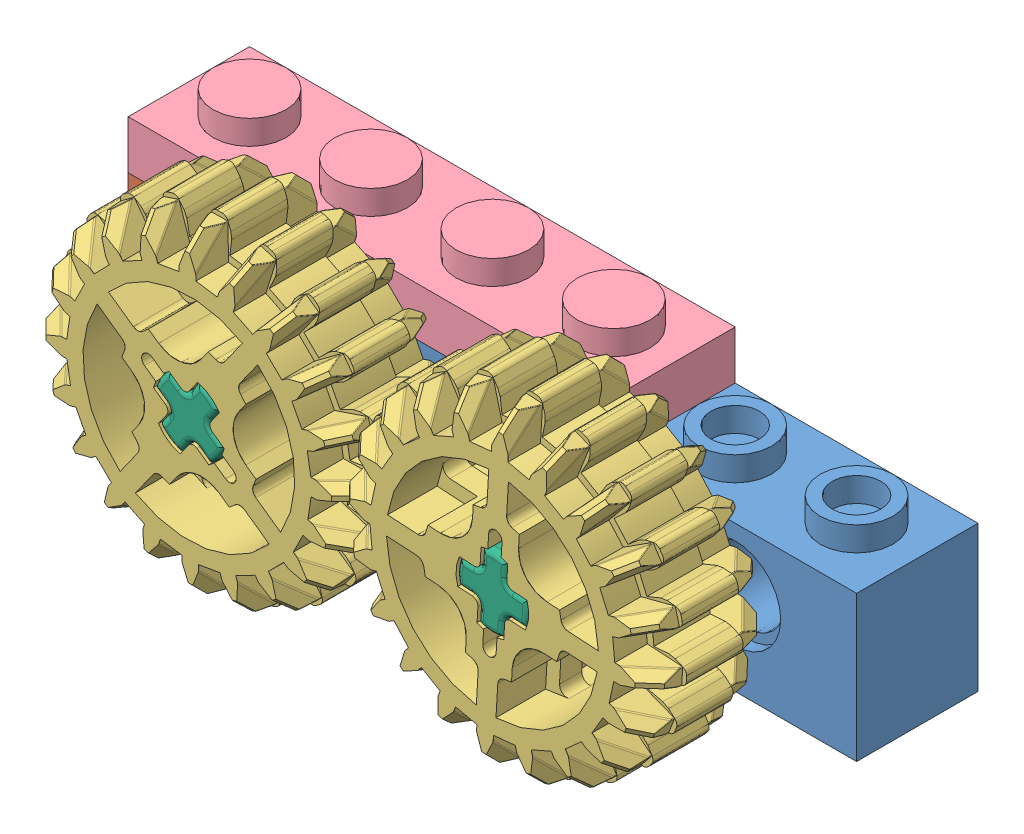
SolidWorks assembly Assem1.sldasm, configuration Default (file format 12000). Lengths in mm.
Overall size (50.87 29.74 16.06).
8 component instances, 6 part files, 21 mates.
Components (placement in the parent):
- 3701 Brick 1 x 4 with Holes Yellow-1: 3701 Brick 1 x 4 with Holes Yellow.SLDPRT [Default] at (12.3915 13.7146 25.8113) size (32 11.2 8)
- 32000 Brick 1 x 2 with Holes Blue-1: 32000 Brick 1 x 2 with Holes Blue.SLDPRT [Default] at (-11.6085 13.7146 25.8113) size (16 11.2 8)
- 32269 Gear 20 Tooth Double Bevel Gray-1: 32269 Gear 20 Tooth Double Bevel Gray.SLDPRT [Default] at (-7.6085 14.5146 33.8113) x (-0.578769 -0.815492 0) z (-0.815492 0.578769 0) size (21.33 8.11 21.33)
- 3710 Plate 1 x 4-1: 3710 Plate 1 x 4.SLDPRT [Default] at (-3.6085 18.5146 25.8113) size (32 4.8 8)
- 3710 Plate 1 x 4 Red-1: 3710 Plate 1 x 4 Red.SLDPRT [Default] at (-3.6085 5.7146 25.8113) size (32 4.8 8)
- 3749 Axle Pin without Friction Ridges Lengthwise-1: 3749 Axle Pin without Friction Ridges Lengthwise.SLDPRT [Default] at (-7.6085 14.5146 29.8113) x (-0.578769 -0.815492 0) z (-0.815492 0.578769 0) size (6 16 6)
- 32269 Gear 20 Tooth Double Bevel Gray-2: 32269 Gear 20 Tooth Double Bevel Gray.SLDPRT [Default] at (12.3915 14.5146 33.8113) x (-0.998259 0.058983 0) z (0.058983 0.998259 0) size (21.33 8.11 21.33)
- 3749 Axle Pin without Friction Ridges Lengthwise-2: 3749 Axle Pin without Friction Ridges Lengthwise.SLDPRT [Default] at (12.3915 14.5146 29.8113) x (-0.058983 -0.998259 0) z (-0.998259 0.058983 0) size (6 16 6)
Mates (geometry in assembly coordinates):
- Coincident1: coincident anti-aligned: plane of 3701 Brick 1 x 4 with Holes Yellow-1 through (-3.6085 18.5146 21.8113) normal (-1 0 0); plane of 32000 Brick 1 x 2 with Holes Blue-1 through (-3.6085 8.9146 21.8113) normal (1 0 0)
- Coincident3: coincident aligned: plane of 3701 Brick 1 x 4 with Holes Yellow-1 through (12.3915 13.7146 29.8113) normal (0 0 1); plane of 32000 Brick 1 x 2 with Holes Blue-1 through (-11.6085 13.7146 29.8113) normal (0 0 1)
- Coincident4: coincident aligned: plane of 3701 Brick 1 x 4 with Holes Yellow-1 through (-3.6085 18.5146 21.8113) normal (0 1 0); plane of 32000 Brick 1 x 2 with Holes Blue-1 through (-19.6085 18.5146 21.8113) normal (0 1 0)
- Tangent1: tangent anti-aligned: plane of 32000 Brick 1 x 2 with Holes Blue-1 through (-11.6085 13.7146 23.4113) normal (0 0 1); cylinder of 3710 Plate 1 x 4 Red-1 through (-15.6085 10.5146 25.8113) axis (0 -1 0) radius 2.4
- Coincident5: coincident aligned: plane of 32000 Brick 1 x 2 with Holes Blue-1 through (-11.6085 13.7146 29.8113) normal (0 0 1); plane of 3710 Plate 1 x 4 Red-1 through (-19.6085 8.9146 29.8113) normal (0 0 1)
- Coincident6: coincident aligned: plane of 32000 Brick 1 x 2 with Holes Blue-1 through (-19.6085 8.9146 21.8113) normal (-1 0 0); plane of 3710 Plate 1 x 4 Red-1 through (-19.6085 8.9146 29.8113) normal (-1 0 0)
- Coincident7: coincident anti-aligned: plane of 32000 Brick 1 x 2 with Holes Blue-1 through (-19.6085 8.9146 21.8113) normal (0 -1 0); plane of 3710 Plate 1 x 4 Red-1 through (-3.6085 8.9146 25.8113) normal (0 1 0)
- Coincident8: coincident aligned: plane of 32000 Brick 1 x 2 with Holes Blue-1 through (-11.6085 13.7146 29.8113) normal (0 0 1); plane of 3710 Plate 1 x 4-1 through (-19.6085 21.7146 29.8113) normal (0 0 1)
- Coincident9: coincident aligned: plane of 32000 Brick 1 x 2 with Holes Blue-1 through (-19.6085 8.9146 21.8113) normal (-1 0 0); plane of 3710 Plate 1 x 4-1 through (-19.6085 21.7146 29.8113) normal (-1 0 0)
- Coincident10: coincident anti-aligned: plane of 32000 Brick 1 x 2 with Holes Blue-1 through (-19.6085 18.5146 21.8113) normal (0 1 0); plane of 3710 Plate 1 x 4-1 through (-3.6085 18.5146 25.8113) normal (0 -1 0)
- Concentric1: concentric aligned: cylinder of 32000 Brick 1 x 2 with Holes Blue-1 through (-7.6085 14.5146 21.8113) axis (0 0 1) radius 2.4; cylinder of 3749 Axle Pin without Friction Ridges Lengthwise-1 through (-7.6085 14.5146 21.8113) axis (0 0 1) radius 2.4
- Concentric2: concentric aligned: cylinder of 3701 Brick 1 x 4 with Holes Yellow-1 through (12.3915 14.5146 21.8113) axis (0 0 1) radius 2.4; cylinder of 3749 Axle Pin without Friction Ridges Lengthwise-2 through (12.3915 14.5146 21.8113) axis (0 0 1) radius 2.4
- Coincident11: coincident anti-aligned: plane of 3701 Brick 1 x 4 with Holes Yellow-1 through (12.3915 14.5146 29.0113) normal (0 0 1); plane of 3749 Axle Pin without Friction Ridges Lengthwise-2 through (12.3915 14.5146 29.0113) normal (0 0 -1)
- Coincident12: coincident anti-aligned: plane of 32000 Brick 1 x 2 with Holes Blue-1 through (-7.6085 14.5146 29.0113) normal (0 0 1); plane of 3749 Axle Pin without Friction Ridges Lengthwise-1 through (-7.6085 14.5146 29.0113) normal (0 0 -1)
- Concentric3: concentric anti-aligned: cylinder of 32269 Gear 20 Tooth Double Bevel Gray-1 through (-7.6085 14.5146 29.7563) axis (0 0 1) radius 2.4; cylinder of 3749 Axle Pin without Friction Ridges Lengthwise-1 through (-7.6085 14.5146 37.8113) axis (0 0 -1) radius 2.4
- Coincident13: coincident anti-aligned: plane of 32269 Gear 20 Tooth Double Bevel Gray-1 through (-7.1252 13.0384 29.7563) normal (0.606877 0.794796 0); plane of 3749 Axle Pin without Friction Ridges Lengthwise-1 through (-9.9172 15.1703 37.8113) normal (-0.606877 -0.794796 0)
- Coincident14: coincident anti-aligned: plane of 32000 Brick 1 x 2 with Holes Blue-1 through (-11.6085 13.7146 29.8113) normal (0 0 1); plane of 32269 Gear 20 Tooth Double Bevel Gray-1 through (-7.6085 14.5146 29.8113) normal (0 0 -1)
- Concentric4: concentric anti-aligned: cylinder of 32269 Gear 20 Tooth Double Bevel Gray-2 through (12.3915 14.5146 29.7563) axis (0 0 1) radius 2.4; cylinder of 3749 Axle Pin without Friction Ridges Lengthwise-2 through (12.3915 14.5146 37.8113) axis (0 0 -1) radius 2.4
- Coincident15: coincident anti-aligned: plane of 32269 Gear 20 Tooth Double Bevel Gray-2 through (13.3021 15.773 29.7563) normal (-0.999709 0.024109 0); plane of 3749 Axle Pin without Friction Ridges Lengthwise-2 through (13.2174 12.2612 37.8113) normal (0.999709 -0.024109 0)
- Coincident16: coincident anti-aligned: plane of 3701 Brick 1 x 4 with Holes Yellow-1 through (12.3915 13.7146 29.8113) normal (0 0 1); plane of 32269 Gear 20 Tooth Double Bevel Gray-2 through (12.3915 14.5146 29.8113) normal (0 0 -1)
- GearMate1: gear = 16.13 mm: circle of 32269 Gear 20 Tooth Double Bevel Gray-1; circle of 32269 Gear 20 Tooth Double Bevel Gray-2
